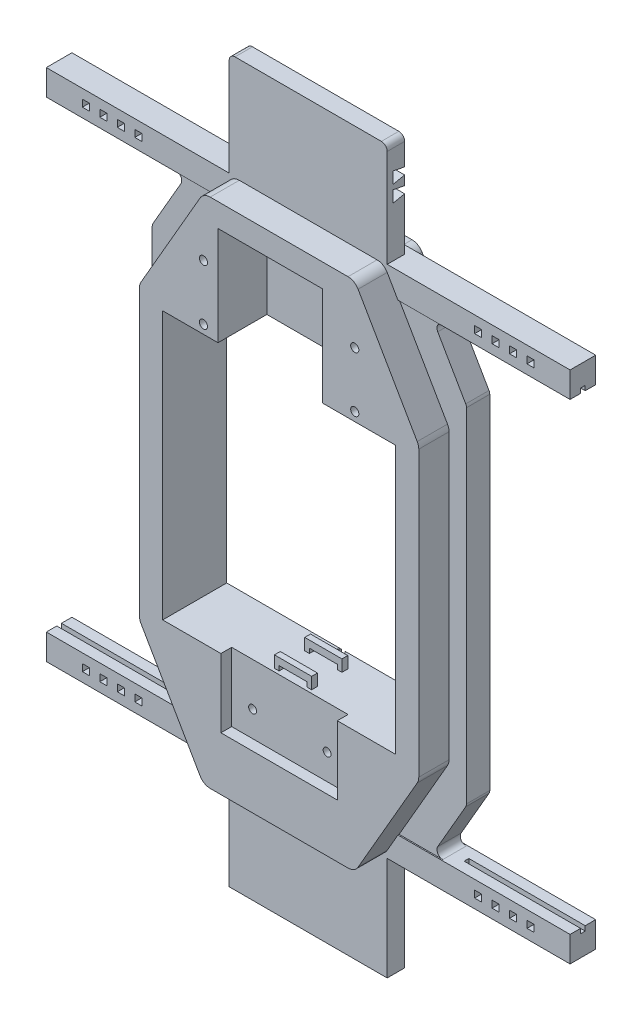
from build123d import *

# Parameters (mm, degrees)
EXTRUDE_1_DEPTH           = 30
EXTRUDE_2_DEPTH           = 40
MIRROR_2_COPY_1_DEPTH     = 40
EXTRUDE_START             = 20
SKETCH_3_W                = 200
SKETCH_3_H                = 230
EXTRUDE_3_DEPTH           = 20
EXTRUDE_START_2           = -10
EXTRUDE_11_DEPTH          = 15
FILLET_3_R                = 5
SKETCH_6_W                = 22
SKETCH_6_H                = 22
EXTRUDE_12_DEPTH          = 225
M8X1_0_1_AT_2_COUNT       = 2
M8X1_0_1_AT_2_PITCH       = 47.5
SKETCH_14_W               = 75
SKETCH_14_H               = 1
CUT_EXTRUDE_1_DEPTH       = 10
SKETCH_15_W               = 6
SKETCH_15_H               = 6
CUT_EXTRUDE_2_DEPTH       = 10
PATTERN_LINEAR_1_COUNT    = 2
PATTERN_LINEAR_1_PITCH    = 30
EXTRUDE_START_3           = -21
EXTRUDE_13_DEPTH          = 20
CUT_EXTRUDE_3_DEPTH       = 20
FILLET_4_R                = 5
SKETCH_18_W               = 4
SKETCH_18_H               = 8
CUT_EXTRUDE_4_DEPTH       = 100
MIRROR_9_COPY_1_SKETCH_W  = 6
MIRROR_9_COPY_1_SKETCH_H  = 6
MIRROR_9_COPY_1_DEPTH     = 10
MIRROR_11_COPY_1_SKETCH_W = 6
MIRROR_11_COPY_1_SKETCH_H = 6
MIRROR_11_COPY_1_DEPTH    = 10
MIRROR_11_COPY_2_SKETCH_W = 6
MIRROR_11_COPY_2_SKETCH_H = 6
MIRROR_11_COPY_2_DEPTH    = 10
MIRROR_11_COPY_3_SKETCH_W = 4
MIRROR_11_COPY_3_SKETCH_H = 8
MIRROR_11_COPY_3_DEPTH    = 100
MIRROR_11_COPY_4_SKETCH_W = 6
MIRROR_11_COPY_4_SKETCH_H = 6
MIRROR_11_COPY_4_DEPTH    = 10
EXTRUDE_14_REACH          = 388.297
EXTRUDE_START_4           = 5
SKETCH_20_W               = 200
SKETCH_20_H               = 230
EXTRUDE_15_DEPTH          = 5
CUT_EXTRUDE_5_DEPTH       = 20
SKETCH_24_W               = 75
SKETCH_24_H               = 85
EXTRUDE_16_DEPTH          = 30
HOLE_WIZARD_M8_1_D        = 6.8
HOLE_WIZARD_M8_1_DEPTH    = 20
HOLE_WIZARD_M8_1_TIP      = 2.042926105
EXTRUDE_START_5           = -12
EXTRUDE_17_DEPTH          = 5
PATTERN_LINEAR_2_COUNT    = 2
PATTERN_LINEAR_2_PITCH    = 26
HOLE_WIZARD_M8_2_D        = 6.8
HOLE_WIZARD_M8_2_DEPTH    = 22.5
HOLE_WIZARD_M8_2_TIP      = 2.042926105
SKETCH_32_W               = 15
SKETCH_32_H               = 85
CUT_EXTRUDE_7_DEPTH       = 30
SKETCH_33_W               = 90
SKETCH_33_H               = 85
CUT_EXTRUDE_8_DEPTH       = 12
SKETCH_34_W               = 100
SKETCH_34_H               = 59
CUT_EXTRUDE_9_DEPTH       = 9.25


with BuildPart() as part:
    # Sketch 1 → Extrude 1 (new body)
    with BuildSketch(Plane.XY):
        with BuildLine():
            Line((-118.660254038, 127.025650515), (-67.868239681, 215))
            ThreePointArc((-67.868239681, 215), (-64.207985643, 218.660254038), (-59.207985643, 220))
            Line((-59.207985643, 220), (59.207985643, 220))
            ThreePointArc((59.207985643, 220), (64.207985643, 218.660254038), (67.868239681, 215))
            Line((67.868239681, 215), (118.660254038, 127.025650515))
            ThreePointArc((118.660254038, 127.025650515), (119.659258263, 124.613840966), (120, 122.025650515))
            Line((120, 122.025650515), (120, -122.025650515))
            ThreePointArc((120, -122.025650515), (119.659258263, -124.613840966), (118.660254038, -127.025650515))
            Line((118.660254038, -127.025650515), (67.868239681, -215))
            ThreePointArc((67.868239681, -215), (64.207985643, -218.660254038), (59.207985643, -220))
            Line((59.207985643, -220), (-59.207985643, -220))
            ThreePointArc((-59.207985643, -220), (-64.207985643, -218.660254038), (-67.868239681, -215))
            Line((-67.868239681, -215), (-118.660254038, -127.025650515))
            ThreePointArc((-118.660254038, -127.025650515), (-119.659258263, -124.613840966), (-120, -122.025650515))
            Line((-120, -122.025650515), (-120, 122.025650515))
            ThreePointArc((-120, 122.025650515), (-119.659258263, 124.613840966), (-118.660254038, 127.025650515))
        make_face()
        with BuildLine():
            Line((-98.660254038, 121.666666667), (-56.321234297, 195))
            ThreePointArc((-56.321234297, 195), (-52.660980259, 198.660254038), (-47.660980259, 200))
            Line((-47.660980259, 200), (47.660980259, 200))
            ThreePointArc((47.660980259, 200), (52.660980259, 198.660254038), (56.321234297, 195))
            Line((56.321234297, 195), (98.660254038, 121.666666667))
            ThreePointArc((98.660254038, 121.666666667), (99.659258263, 119.254857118), (100, 116.666666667))
            Line((100, 116.666666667), (100, -116.666666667))
            ThreePointArc((100, -116.666666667), (99.659258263, -119.254857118), (98.660254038, -121.666666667))
            Line((98.660254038, -121.666666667), (56.321234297, -195))
            ThreePointArc((56.321234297, -195), (52.660980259, -198.660254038), (47.660980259, -200))
            Line((47.660980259, -200), (-47.660980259, -200))
            ThreePointArc((-47.660980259, -200), (-52.660980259, -198.660254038), (-56.321234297, -195))
            Line((-56.321234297, -195), (-98.660254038, -121.666666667))
            ThreePointArc((-98.660254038, -121.666666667), (-99.659258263, -119.254857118), (-100, -116.666666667))
            Line((-100, -116.666666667), (-100, 116.666666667))
            ThreePointArc((-100, 116.666666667), (-99.659258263, 119.254857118), (-98.660254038, 121.666666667))
        make_face(mode=Mode.SUBTRACT)
    extrude(amount=EXTRUDE_1_DEPTH)

    # Sketch 2 → Extrude 2 (add)
    with BuildSketch(Plane.XY.offset(30)):
        Polygon((-100, 130), (-70, 130), (-70, 200), (-37.5, 200), (-37.5, 115), (-100, 115), align=None)
    extrude_2 = extrude(amount=-EXTRUDE_2_DEPTH)

    # Mirror 1: Extrude 2 across plane
    add(extrude_2.mirror(Plane.ZX))

    # Mirror 2: Extrude 2 across plane
    add(extrude_2.mirror(Plane(origin=(0, 0, 0), x_dir=(0, 0, 1), z_dir=(1, 0, 0))))

    # Mirror 2 copy 1 sketch → Mirror 2 copy 1 (add)
    with BuildSketch(Plane(origin=(0, 0, 30), x_dir=(-1, 0, 0), z_dir=(0, 0, 1))):
        Polygon((-100, 130), (-70, 130), (-70, 200), (-37.5, 200), (-37.5, 115), (-100, 115), align=None)
    extrude(amount=-MIRROR_2_COPY_1_DEPTH)

    # Sketch 3 → Extrude 3 (add)
    with BuildSketch(Plane(origin=(0, 0, 0), x_dir=(-1, 0, 0), z_dir=(0, 0, -1)).offset(EXTRUDE_START)):
        with BuildLine():
            Line((120, -122.025650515), (120, 122.025650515))
            ThreePointArc((120, 122.025650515), (119.659258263, 124.613840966), (118.660254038, 127.025650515))
            Line((118.660254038, 127.025650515), (67.868239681, 215))
            ThreePointArc((67.868239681, 215), (64.207985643, 218.660254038), (59.207985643, 220))
            Line((59.207985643, 220), (-59.207985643, 220))
            ThreePointArc((-59.207985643, 220), (-64.207985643, 218.660254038), (-67.868239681, 215))
            Line((-67.868239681, 215), (-118.660254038, 127.025650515))
            ThreePointArc((-118.660254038, 127.025650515), (-119.659258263, 124.613840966), (-120, 122.025650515))
            Line((-120, 122.025650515), (-120, -122.025650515))
            ThreePointArc((-120, -122.025650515), (-119.659258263, -124.613840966), (-118.660254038, -127.025650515))
            Line((-118.660254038, -127.025650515), (-67.868239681, -215))
            ThreePointArc((-67.868239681, -215), (-64.207985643, -218.660254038), (-59.207985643, -220))
            Line((-59.207985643, -220), (59.207985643, -220))
            ThreePointArc((59.207985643, -220), (64.207985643, -218.660254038), (67.868239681, -215))
            Line((67.868239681, -215), (118.660254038, -127.025650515))
            ThreePointArc((118.660254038, -127.025650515), (119.659258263, -124.613840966), (120, -122.025650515))
        make_face()
        Rectangle(SKETCH_3_W, SKETCH_3_H, mode=Mode.SUBTRACT)
    extrude(amount=-EXTRUDE_3_DEPTH)

    # Sketch 5 → Extrude 11 (add)
    with BuildSketch(Plane(origin=(0, 0, -20), x_dir=(-1, 0, 0), z_dir=(0, 0, -1)).offset(EXTRUDE_START_2)):
        with BuildLine():
            Line((-67.868239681, 215), (-67.868239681, 310))
            Line((-67.868239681, 310), (67.868239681, 310))
            Line((67.868239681, 310), (67.868239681, 215))
            ThreePointArc((67.868239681, 215), (64.207985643, 218.660254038), (59.207985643, 220))
            Line((59.207985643, 220), (-59.207985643, 220))
            ThreePointArc((-59.207985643, 220), (-64.207985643, 218.660254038), (-67.868239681, 215))
        make_face()
    extrude_11 = extrude(amount=-EXTRUDE_11_DEPTH)

    # Fillet 3
    fillet_3_edges = [part.edges().sort_by_distance(p)[0] for p in [
        (67.868239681, 310, -2.5),
        (-67.868239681, 310, -2.5),
    ]]
    fillet(fillet_3_edges, radius=FILLET_3_R)

    # Sketch 6 → Extrude 12 (add, symmetric)
    with BuildSketch(Plane(origin=(0, 0, 0), x_dir=(0, 0, -1), z_dir=(1, 0, 0))):
        with Locations((6, 210)):
            Rectangle(SKETCH_6_W, SKETCH_6_H)
    extrude_12 = extrude(amount=EXTRUDE_12_DEPTH, both=True)

    # Sketch 11 → M8x1.0 _1 (revolve, cut)
    with BuildSketch(Plane(origin=(-65, 122.5, 30), x_dir=(0, -1, 0), z_dir=(1, 0, 0))):
        Polygon((0, 0), (0, 23.103012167), (3.5, 21), (3.5, 0), align=None)
    m8x1_0_1 = revolve(axis=Axis((-65, 122.5, 36.35), (0, 0, -1)), mode=Mode.SUBTRACT)

    # M8x1.0 _1 at 2: M8x1.0 _1 ×2
    with Locations(*[(0, i * M8X1_0_1_AT_2_PITCH, 0) for i in range(1, M8X1_0_1_AT_2_COUNT)]):
        add(m8x1_0_1, mode=Mode.SUBTRACT)

    # Mirror 7: M8x1.0 _1 across plane
    add(m8x1_0_1.mirror(Plane(origin=(0, 0, 0), x_dir=(0, 0, 1), z_dir=(1, 0, 0))), mode=Mode.SUBTRACT)

    # Mirror 7 copy 1 sketch → Mirror 7 copy 1 (revolve, cut)
    with BuildSketch(Plane(origin=(65, 170, 30), x_dir=(0, -1, 0), z_dir=(-1, 0, 0))):
        Polygon((0, 0), (0, -23.103012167), (3.5, -21), (3.5, 0), align=None)
    revolve(axis=Axis((65, 170, 36.35), (0, 0, 1)), mode=Mode.SUBTRACT)

    # Sketch 14 → Cut-Extrude 1 (cut)
    with BuildSketch(Plane.XY):
        with Locations((0, 199.5)):
            Rectangle(SKETCH_14_W, SKETCH_14_H)
    cut_extrude_1 = extrude(amount=CUT_EXTRUDE_1_DEPTH, mode=Mode.SUBTRACT)

    # Mirror 8: Extrude 11, Extrude 12, Cut-Extrude 1 across plane
    add(extrude_11.mirror(Plane.ZX))
    add(extrude_12.mirror(Plane.ZX))
    add(cut_extrude_1.mirror(Plane.ZX), mode=Mode.SUBTRACT)

    # Sketch 15 → Cut-Extrude 2 (cut)
    with BuildSketch(Plane.XY.offset(5)):
        with Locations((191, 210)):
            Rectangle(SKETCH_15_W, SKETCH_15_H)
        with Locations((176, 210)):
            Rectangle(SKETCH_15_W, SKETCH_15_H)
    cut_extrude_2 = extrude(amount=-CUT_EXTRUDE_2_DEPTH, mode=Mode.SUBTRACT)

    # Pattern Linear 1: Cut-Extrude 2 ×2
    with Locations(*[(-i * PATTERN_LINEAR_1_PITCH, 0, 0) for i in range(1, PATTERN_LINEAR_1_COUNT)]):
        add(cut_extrude_2, mode=Mode.SUBTRACT)

    # Sketch 16 → Extrude 13 (add)
    with BuildSketch(Plane.XY.offset(5).offset(EXTRUDE_START_3)):
        with BuildLine():
            Line((135, 199), (135, -199))
            Line((135, -199), (77.105843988, -199))
            Line((77.105843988, -199), (118.660254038, -127.025650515))
            ThreePointArc((118.660254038, -127.025650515), (119.659258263, -124.613840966), (120, -122.025650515))
            Line((120, -122.025650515), (120, 122.025650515))
            ThreePointArc((120, 122.025650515), (119.659258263, 124.613840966), (118.660254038, 127.025650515))
            Line((118.660254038, 127.025650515), (77.105843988, 199))
            Line((77.105843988, 199), (135, 199))
        make_face()
        with BuildLine():
            Line((-135, 199), (-77.105843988, 199))
            Line((-77.105843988, 199), (-118.660254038, 127.025650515))
            ThreePointArc((-118.660254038, 127.025650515), (-119.659258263, 124.613840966), (-120, 122.025650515))
            Line((-120, 122.025650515), (-120, -122.025650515))
            ThreePointArc((-120, -122.025650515), (-119.659258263, -124.613840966), (-118.660254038, -127.025650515))
            Line((-118.660254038, -127.025650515), (-77.105843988, -199))
            Line((-77.105843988, -199), (-135, -199))
            Line((-135, -199), (-135, 199))
        make_face()
    extrude(amount=EXTRUDE_13_DEPTH)

    # Sketch 17 → Cut-Extrude 3 (cut)
    with BuildSketch(Plane.XY.offset(4)):
        Polygon((105.973357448, 199), (135, 148.724380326), (135, 199), align=None)
        Polygon((135, -199), (105.973357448, -199), (135, -148.724380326), align=None)
        Polygon((-105.973357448, -199), (-135, -148.724380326), (-135, -199), align=None)
        Polygon((-135, 199), (-105.973357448, 199), (-135, 148.724380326), align=None)
    extrude(amount=-CUT_EXTRUDE_3_DEPTH, mode=Mode.SUBTRACT)

    # Fillet 4
    fillet_4_edges = [part.edges().sort_by_distance(p)[0] for p in [
        (-135, 148.724380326, -6),
        (-105.973357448, 199, -6),
        (-105.973357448, -199, -6),
        (-135, -148.724380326, -6),
        (135, -148.724380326, -6),
        (105.973357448, -199, -6),
        (105.973357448, 199, -6),
        (135, 148.724380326, -6),
    ]]
    fillet(fillet_4_edges, radius=FILLET_4_R)

    # Sketch 18 → Cut-Extrude 4 (cut)
    with BuildSketch(Plane(origin=(225, 0, 0), x_dir=(0, 0, -1), z_dir=(1, 0, 0))):
        with Locations((6, 199)):
            Rectangle(SKETCH_18_W, SKETCH_18_H)
    cut_extrude_4 = extrude(amount=-CUT_EXTRUDE_4_DEPTH, mode=Mode.SUBTRACT)

    # Mirror 9: Cut-Extrude 2, Cut-Extrude 4 across plane
    add(cut_extrude_2.mirror(Plane.ZX), mode=Mode.SUBTRACT)
    add(cut_extrude_4.mirror(Plane.ZX), mode=Mode.SUBTRACT)

    # Mirror 9 copy 1 sketch → Mirror 9 copy 1 (cut)
    with BuildSketch(Plane(origin=(-30, 0, 5), x_dir=(1, 0, 0), z_dir=(0, 0, 1))):
        with Locations((191, -210)):
            Rectangle(MIRROR_9_COPY_1_SKETCH_W, MIRROR_9_COPY_1_SKETCH_H)
        with Locations((176, -210)):
            Rectangle(MIRROR_9_COPY_1_SKETCH_W, MIRROR_9_COPY_1_SKETCH_H)
    extrude(amount=-MIRROR_9_COPY_1_DEPTH, mode=Mode.SUBTRACT)

    # Mirror 11: Cut-Extrude 2, Cut-Extrude 4 across plane
    add(cut_extrude_2.mirror(Plane(origin=(0, 0, 0), x_dir=(0, 0, 1), z_dir=(1, 0, 0))), mode=Mode.SUBTRACT)
    add(cut_extrude_4.mirror(Plane(origin=(0, 0, 0), x_dir=(0, 0, 1), z_dir=(1, 0, 0))), mode=Mode.SUBTRACT)

    # Mirror 11 copy 1 sketch → Mirror 11 copy 1 (cut)
    with BuildSketch(Plane(origin=(30, 0, 5), x_dir=(-1, 0, 0), z_dir=(0, 0, 1))):
        with Locations((191, -210)):
            Rectangle(MIRROR_11_COPY_1_SKETCH_W, MIRROR_11_COPY_1_SKETCH_H)
        with Locations((176, -210)):
            Rectangle(MIRROR_11_COPY_1_SKETCH_W, MIRROR_11_COPY_1_SKETCH_H)
    extrude(amount=-MIRROR_11_COPY_1_DEPTH, mode=Mode.SUBTRACT)

    # Mirror 11 copy 2 sketch → Mirror 11 copy 2 (cut)
    with BuildSketch(Plane(origin=(0, 0, 5), x_dir=(-1, 0, 0), z_dir=(0, 0, 1))):
        with Locations((191, 210)):
            Rectangle(MIRROR_11_COPY_2_SKETCH_W, MIRROR_11_COPY_2_SKETCH_H)
        with Locations((176, 210)):
            Rectangle(MIRROR_11_COPY_2_SKETCH_W, MIRROR_11_COPY_2_SKETCH_H)
    extrude(amount=-MIRROR_11_COPY_2_DEPTH, mode=Mode.SUBTRACT)

    # Mirror 11 copy 3 sketch → Mirror 11 copy 3 (cut)
    with BuildSketch(Plane(origin=(-225, 0, 0), x_dir=(0, 0, -1), z_dir=(-1, 0, 0))):
        with Locations((6, 199)):
            Rectangle(MIRROR_11_COPY_3_SKETCH_W, MIRROR_11_COPY_3_SKETCH_H)
    extrude(amount=-MIRROR_11_COPY_3_DEPTH, mode=Mode.SUBTRACT)

    # Mirror 11 copy 4 sketch → Mirror 11 copy 4 (cut)
    with BuildSketch(Plane(origin=(30, 0, 5), x_dir=(-1, 0, 0), z_dir=(0, 0, 1))):
        with Locations((191, 210)):
            Rectangle(MIRROR_11_COPY_4_SKETCH_W, MIRROR_11_COPY_4_SKETCH_H)
        with Locations((176, 210)):
            Rectangle(MIRROR_11_COPY_4_SKETCH_W, MIRROR_11_COPY_4_SKETCH_H)
    extrude(amount=-MIRROR_11_COPY_4_DEPTH, mode=Mode.SUBTRACT)

    # Sketch 19 → Extrude 14 (add, up to next)
    with BuildSketch(Plane.XY.offset(30), mode=Mode.PRIVATE) as extrude_14_sk1:
        Polygon((-93.849001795, 130), (-70, 130), (-70, 171.307682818), align=None)
    extrude_14_tool1 = extrude(extrude_14_sk1.sketch, amount=-EXTRUDE_14_REACH, mode=Mode.PRIVATE) - part.part
    # Sketch 19 → Extrude 14 (add, up to next)
    with BuildSketch(Plane.XY.offset(30), mode=Mode.PRIVATE) as extrude_14_sk2:
        Polygon((93.849001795, 130), (70, 171.307682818), (70, 130), align=None)
    extrude_14_tool2 = extrude(extrude_14_sk2.sketch, amount=-EXTRUDE_14_REACH, mode=Mode.PRIVATE) - part.part
    # Sketch 19 → Extrude 14 (add, up to next)
    with BuildSketch(Plane.XY.offset(30), mode=Mode.PRIVATE) as extrude_14_sk3:
        Polygon((93.849001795, -130), (70, -130), (70, -171.307682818), align=None)
    extrude_14_tool3 = extrude(extrude_14_sk3.sketch, amount=-EXTRUDE_14_REACH, mode=Mode.PRIVATE) - part.part
    # Sketch 19 → Extrude 14 (add, up to next)
    with BuildSketch(Plane.XY.offset(30), mode=Mode.PRIVATE) as extrude_14_sk4:
        Polygon((-93.849001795, -130), (-70, -171.307682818), (-70, -130), align=None)
    extrude_14_tool4 = extrude(extrude_14_sk4.sketch, amount=-EXTRUDE_14_REACH, mode=Mode.PRIVATE) - part.part
    add(extrude_14_tool1.solids().sort_by_distance((-77.949667, 143.769228, 30))[0])
    add(extrude_14_tool2.solids().sort_by_distance((77.949667, 143.769228, 30))[0])
    add(extrude_14_tool3.solids().sort_by_distance((77.949667, -143.769228, 30))[0])
    add(extrude_14_tool4.solids().sort_by_distance((-77.949667, -143.769228, 30))[0])

    # Sketch 20 → Extrude 15 (add)
    with BuildSketch(Plane(origin=(0, 0, -20), x_dir=(-1, 0, 0), z_dir=(0, 0, -1)).offset(EXTRUDE_START_4)):
        with BuildLine():
            Line((120, -122.025650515), (120, 122.025650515))
            ThreePointArc((120, 122.025650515), (119.659258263, 124.613840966), (118.660254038, 127.025650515))
            Line((118.660254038, 127.025650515), (67.868239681, 215))
            ThreePointArc((67.868239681, 215), (64.207985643, 218.660254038), (59.207985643, 220))
            Line((59.207985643, 220), (-59.207985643, 220))
            ThreePointArc((-59.207985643, 220), (-64.207985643, 218.660254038), (-67.868239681, 215))
            Line((-67.868239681, 215), (-118.660254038, 127.025650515))
            ThreePointArc((-118.660254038, 127.025650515), (-119.659258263, 124.613840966), (-120, 122.025650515))
            Line((-120, 122.025650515), (-120, -122.025650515))
            ThreePointArc((-120, -122.025650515), (-119.659258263, -124.613840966), (-118.660254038, -127.025650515))
            Line((-118.660254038, -127.025650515), (-67.868239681, -215))
            ThreePointArc((-67.868239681, -215), (-64.207985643, -218.660254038), (-59.207985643, -220))
            Line((-59.207985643, -220), (59.207985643, -220))
            ThreePointArc((59.207985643, -220), (64.207985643, -218.660254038), (67.868239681, -215))
            Line((67.868239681, -215), (118.660254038, -127.025650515))
            ThreePointArc((118.660254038, -127.025650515), (119.659258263, -124.613840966), (120, -122.025650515))
        make_face()
        Rectangle(SKETCH_20_W, SKETCH_20_H, mode=Mode.SUBTRACT)
    extrude(amount=-EXTRUDE_15_DEPTH)

    # Sketch 22 → Cut-Extrude 5 (cut)
    with BuildSketch(Plane(origin=(67.868239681, 0, 0), x_dir=(0, 0, -1), z_dir=(1, 0, 0))):
        Polygon((0, 264), (10, 266), (10, 272), (0, 274), align=None)
        Polygon((0, 278), (10, 280), (10, 286), (0, 288), align=None)
    cut_extrude_5 = extrude(amount=-CUT_EXTRUDE_5_DEPTH, mode=Mode.SUBTRACT)

    # Mirror 12: Cut-Extrude 5 across plane
    add(cut_extrude_5.mirror(Plane(origin=(0, 0, 0), x_dir=(0, 0, 1), z_dir=(1, 0, 0))), mode=Mode.SUBTRACT)

    # Sketch 24 → Extrude 16 (add)
    with BuildSketch(Plane.XY):
        with Locations((0, -157.5)):
            Rectangle(SKETCH_24_W, SKETCH_24_H)
    extrude(amount=EXTRUDE_16_DEPTH)

    # Hole Wizard M8 _1
    with Locations(Plane(origin=(0, -115, -22), x_dir=(0, 0, 1), z_dir=(0, 1, 0))):
        with Locations((0, 0)):
            Hole(HOLE_WIZARD_M8_1_D / 2, depth=HOLE_WIZARD_M8_1_DEPTH)
            with Locations((0, 0, -(HOLE_WIZARD_M8_1_DEPTH + HOLE_WIZARD_M8_1_TIP / 2))):  # 118° drill point
                Cone(0, HOLE_WIZARD_M8_1_D / 2, HOLE_WIZARD_M8_1_TIP, mode=Mode.SUBTRACT)

    # Sketch 27 → Extrude 17 (add)
    with BuildSketch(Plane.XY.offset(30).offset(EXTRUDE_START_5)):
        Polygon((-16, -115), (-16, -105), (16, -105), (16, -115), (12, -115), (12, -111), (-12, -111), (-12, -115), align=None)
    extrude_17 = extrude(amount=-EXTRUDE_17_DEPTH)

    # Pattern Linear 2: Extrude 17 ×2
    with Locations(*[(0, 0, -i * PATTERN_LINEAR_2_PITCH) for i in range(1, PATTERN_LINEAR_2_COUNT)]):
        add(extrude_17)

    # Hole Wizard M8 _2
    with Locations(Plane(origin=(-32, -152, 30), x_dir=(1, 0, 0), z_dir=(0, 0, 1))):
        with Locations((0, 0), (64, 0)):
            Hole(HOLE_WIZARD_M8_2_D / 2, depth=HOLE_WIZARD_M8_2_DEPTH)
            with Locations((0, 0, -(HOLE_WIZARD_M8_2_DEPTH + HOLE_WIZARD_M8_2_TIP / 2))):  # 118° drill point
                Cone(0, HOLE_WIZARD_M8_2_D / 2, HOLE_WIZARD_M8_2_TIP, mode=Mode.SUBTRACT)

    # Sketch 32 → Cut-Extrude 7 (cut)
    with BuildSketch(Plane.XY.offset(30)):
        with Locations((-45, 157.5)):
            Rectangle(SKETCH_32_W, SKETCH_32_H)
    extrude(amount=-CUT_EXTRUDE_7_DEPTH, mode=Mode.SUBTRACT)

    # Sketch 33 → Cut-Extrude 8 (cut)
    with BuildSketch(Plane.XY):
        with Locations((-7.5, 157.5)):
            Rectangle(SKETCH_33_W, SKETCH_33_H)
    extrude(amount=-CUT_EXTRUDE_8_DEPTH, mode=Mode.SUBTRACT)

    # Sketch 34 → Cut-Extrude 9 (cut)
    with BuildSketch(Plane.XY.offset(30)):
        with Locations((0, -144.5)):
            Rectangle(SKETCH_34_W, SKETCH_34_H)
    extrude(amount=-CUT_EXTRUDE_9_DEPTH, mode=Mode.SUBTRACT)


solid = part.part
